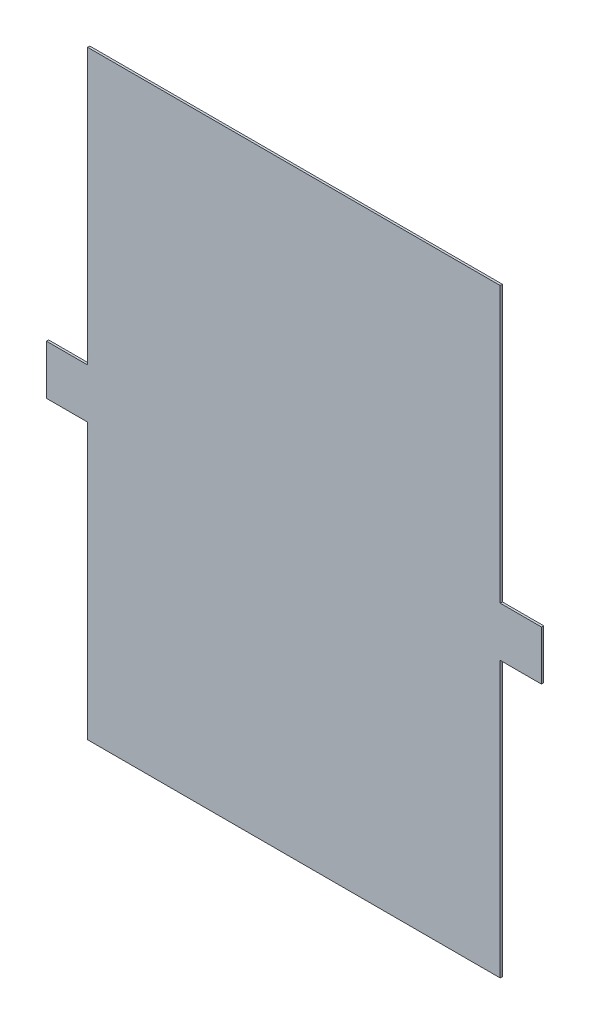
ISO-10303-21;
HEADER;
FILE_DESCRIPTION(('STEP AP214'),'2;1');
FILE_NAME('part.step','',(''),(''),'','','');
FILE_SCHEMA(('AUTOMOTIVE_DESIGN { 1 0 10303 214 1 1 1 1 }'));
ENDSEC;
DATA;
#1=APPLICATION_CONTEXT('core data for automotive mechanical design processes');
#2=APPLICATION_PROTOCOL_DEFINITION('international standard','automotive_design',2000,#1);
#3=PRODUCT_CONTEXT('',#1,'mechanical');
#4=PRODUCT('Part','Part','',(#3));
#5=PRODUCT_RELATED_PRODUCT_CATEGORY('part','',(#4));
#6=PRODUCT_DEFINITION_FORMATION('','',#4);
#7=PRODUCT_DEFINITION_CONTEXT('part definition',#1,'design');
#8=PRODUCT_DEFINITION('design','',#6,#7);
#9=PRODUCT_DEFINITION_SHAPE('','',#8);
#10=(LENGTH_UNIT() NAMED_UNIT(*) SI_UNIT(.MILLI.,.METRE.));
#11=(NAMED_UNIT(*) PLANE_ANGLE_UNIT() SI_UNIT($,.RADIAN.));
#12=(NAMED_UNIT(*) SI_UNIT($,.STERADIAN.) SOLID_ANGLE_UNIT());
#13=UNCERTAINTY_MEASURE_WITH_UNIT(LENGTH_MEASURE(1.E-05),#10,'distance_accuracy_value','');
#14=(GEOMETRIC_REPRESENTATION_CONTEXT(3) GLOBAL_UNCERTAINTY_ASSIGNED_CONTEXT((#13)) GLOBAL_UNIT_ASSIGNED_CONTEXT((#10,
#11,#12)) REPRESENTATION_CONTEXT('',''));
#15=CARTESIAN_POINT('',(0.,0.,0.));
#16=DIRECTION('',(0.,0.,1.));
#17=DIRECTION('',(1.,0.,0.));
#18=AXIS2_PLACEMENT_3D('',#15,#16,#17);
#19=CARTESIAN_POINT('',(-251.568085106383,267.960992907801,2.032));
#20=DIRECTION('',(1.,0.,0.));
#21=DIRECTION('',(0.,0.,-1.));
#22=AXIS2_PLACEMENT_3D('',#19,#20,#21);
#23=PLANE('',#22);
#24=DIRECTION('',(0.,-1.,0.));
#25=VECTOR('',#24,1.);
#26=CARTESIAN_POINT('',(-251.568085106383,267.960992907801,0.));
#27=LINE('',#26,#25);
#28=CARTESIAN_POINT('',(-251.568085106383,267.960992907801,0.));
#29=VERTEX_POINT('',#28);
#30=CARTESIAN_POINT('',(-251.568085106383,13.9609929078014,0.));
#31=VERTEX_POINT('',#30);
#32=EDGE_CURVE('E153',#29,#31,#27,.T.);
#33=ORIENTED_EDGE('',*,*,#32,.T.);
#34=DIRECTION('',(0.,0.,-1.));
#35=VECTOR('',#34,1.);
#36=CARTESIAN_POINT('',(-251.568085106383,13.9609929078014,2.032));
#37=LINE('',#36,#35);
#38=CARTESIAN_POINT('',(-251.568085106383,13.9609929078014,2.032));
#39=VERTEX_POINT('',#38);
#40=EDGE_CURVE('E11',#39,#31,#37,.T.);
#41=ORIENTED_EDGE('',*,*,#40,.F.);
#42=DIRECTION('',(0.,-1.,0.));
#43=VECTOR('',#42,1.);
#44=CARTESIAN_POINT('',(-251.568085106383,267.960992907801,2.032));
#45=LINE('',#44,#43);
#46=CARTESIAN_POINT('',(-251.568085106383,267.960992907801,2.032));
#47=VERTEX_POINT('',#46);
#48=EDGE_CURVE('E175',#47,#39,#45,.T.);
#49=ORIENTED_EDGE('',*,*,#48,.F.);
#50=DIRECTION('',(0.,0.,-1.));
#51=VECTOR('',#50,1.);
#52=CARTESIAN_POINT('',(-251.568085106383,267.960992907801,2.032));
#53=LINE('',#52,#51);
#54=EDGE_CURVE('E149',#47,#29,#53,.T.);
#55=ORIENTED_EDGE('',*,*,#54,.T.);
#56=EDGE_LOOP('',(#33,#41,#49,#55));
#57=FACE_BOUND('',#56,.T.);
#58=ADVANCED_FACE('F33',(#57),#23,.F.);
#59=CARTESIAN_POINT('',(-251.568085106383,13.9609929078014,2.032));
#60=DIRECTION('',(0.,-1.,0.));
#61=DIRECTION('',(1.,0.,0.));
#62=AXIS2_PLACEMENT_3D('',#59,#60,#61);
#63=PLANE('',#62);
#64=DIRECTION('',(-1.,0.,0.));
#65=VECTOR('',#64,1.);
#66=CARTESIAN_POINT('',(-251.568085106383,13.9609929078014,0.));
#67=LINE('',#66,#65);
#68=CARTESIAN_POINT('',(-289.668085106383,13.9609929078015,0.));
#69=VERTEX_POINT('',#68);
#70=EDGE_CURVE('E156',#31,#69,#67,.T.);
#71=ORIENTED_EDGE('',*,*,#70,.T.);
#72=DIRECTION('',(0.,0.,-1.));
#73=VECTOR('',#72,1.);
#74=CARTESIAN_POINT('',(-289.668085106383,13.9609929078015,2.032));
#75=LINE('',#74,#73);
#76=CARTESIAN_POINT('',(-289.668085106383,13.9609929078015,2.032));
#77=VERTEX_POINT('',#76);
#78=EDGE_CURVE('E41',#77,#69,#75,.T.);
#79=ORIENTED_EDGE('',*,*,#78,.F.);
#80=DIRECTION('',(-1.,0.,0.));
#81=VECTOR('',#80,1.);
#82=CARTESIAN_POINT('',(-251.568085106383,13.9609929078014,2.032));
#83=LINE('',#82,#81);
#84=EDGE_CURVE('E104',#39,#77,#83,.T.);
#85=ORIENTED_EDGE('',*,*,#84,.F.);
#86=ORIENTED_EDGE('',*,*,#40,.T.);
#87=EDGE_LOOP('',(#71,#79,#85,#86));
#88=FACE_BOUND('',#87,.T.);
#89=ADVANCED_FACE('F253',(#88),#63,.F.);
#90=CARTESIAN_POINT('',(-289.668085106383,13.9609929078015,2.032));
#91=DIRECTION('',(1.,0.,0.));
#92=DIRECTION('',(0.,1.,0.));
#93=AXIS2_PLACEMENT_3D('',#90,#91,#92);
#94=PLANE('',#93);
#95=DIRECTION('',(0.,-1.,0.));
#96=VECTOR('',#95,1.);
#97=CARTESIAN_POINT('',(-289.668085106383,13.9609929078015,0.));
#98=LINE('',#97,#96);
#99=CARTESIAN_POINT('',(-289.668085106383,-31.7590070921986,0.));
#100=VERTEX_POINT('',#99);
#101=EDGE_CURVE('E158',#69,#100,#98,.T.);
#102=ORIENTED_EDGE('',*,*,#101,.T.);
#103=DIRECTION('',(0.,0.,-1.));
#104=VECTOR('',#103,1.);
#105=CARTESIAN_POINT('',(-289.668085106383,-31.7590070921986,2.032));
#106=LINE('',#105,#104);
#107=CARTESIAN_POINT('',(-289.668085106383,-31.7590070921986,2.032));
#108=VERTEX_POINT('',#107);
#109=EDGE_CURVE('E194',#108,#100,#106,.T.);
#110=ORIENTED_EDGE('',*,*,#109,.F.);
#111=DIRECTION('',(0.,-1.,0.));
#112=VECTOR('',#111,1.);
#113=CARTESIAN_POINT('',(-289.668085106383,13.9609929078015,2.032));
#114=LINE('',#113,#112);
#115=EDGE_CURVE('E202',#77,#108,#114,.T.);
#116=ORIENTED_EDGE('',*,*,#115,.F.);
#117=ORIENTED_EDGE('',*,*,#78,.T.);
#118=EDGE_LOOP('',(#102,#110,#116,#117));
#119=FACE_BOUND('',#118,.T.);
#120=ADVANCED_FACE('F200',(#119),#94,.F.);
#121=CARTESIAN_POINT('',(-289.668085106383,-31.7590070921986,2.032));
#122=DIRECTION('',(0.,1.,0.));
#123=DIRECTION('',(0.,0.,1.));
#124=AXIS2_PLACEMENT_3D('',#121,#122,#123);
#125=PLANE('',#124);
#126=DIRECTION('',(1.,0.,0.));
#127=VECTOR('',#126,1.);
#128=CARTESIAN_POINT('',(-289.668085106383,-31.7590070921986,0.));
#129=LINE('',#128,#127);
#130=CARTESIAN_POINT('',(-251.568085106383,-31.7590070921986,0.));
#131=VERTEX_POINT('',#130);
#132=EDGE_CURVE('E160',#100,#131,#129,.T.);
#133=ORIENTED_EDGE('',*,*,#132,.T.);
#134=DIRECTION('',(0.,0.,-1.));
#135=VECTOR('',#134,1.);
#136=CARTESIAN_POINT('',(-251.568085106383,-31.7590070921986,2.032));
#137=LINE('',#136,#135);
#138=CARTESIAN_POINT('',(-251.568085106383,-31.7590070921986,2.032));
#139=VERTEX_POINT('',#138);
#140=EDGE_CURVE('E191',#139,#131,#137,.T.);
#141=ORIENTED_EDGE('',*,*,#140,.F.);
#142=DIRECTION('',(1.,0.,0.));
#143=VECTOR('',#142,1.);
#144=CARTESIAN_POINT('',(-289.668085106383,-31.7590070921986,2.032));
#145=LINE('',#144,#143);
#146=EDGE_CURVE('E220',#108,#139,#145,.T.);
#147=ORIENTED_EDGE('',*,*,#146,.F.);
#148=ORIENTED_EDGE('',*,*,#109,.T.);
#149=EDGE_LOOP('',(#133,#141,#147,#148));
#150=FACE_BOUND('',#149,.T.);
#151=ADVANCED_FACE('F211',(#150),#125,.F.);
#152=CARTESIAN_POINT('',(-251.568085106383,-31.7590070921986,2.032));
#153=DIRECTION('',(1.,0.,0.));
#154=DIRECTION('',(0.,1.,0.));
#155=AXIS2_PLACEMENT_3D('',#152,#153,#154);
#156=PLANE('',#155);
#157=DIRECTION('',(0.,-1.,0.));
#158=VECTOR('',#157,1.);
#159=CARTESIAN_POINT('',(-251.568085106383,-31.7590070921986,0.));
#160=LINE('',#159,#158);
#161=CARTESIAN_POINT('',(-251.568085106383,-285.759007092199,0.));
#162=VERTEX_POINT('',#161);
#163=EDGE_CURVE('E162',#131,#162,#160,.T.);
#164=ORIENTED_EDGE('',*,*,#163,.T.);
#165=DIRECTION('',(0.,0.,-1.));
#166=VECTOR('',#165,1.);
#167=CARTESIAN_POINT('',(-251.568085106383,-285.759007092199,2.032));
#168=LINE('',#167,#166);
#169=CARTESIAN_POINT('',(-251.568085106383,-285.759007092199,2.032));
#170=VERTEX_POINT('',#169);
#171=EDGE_CURVE('E188',#170,#162,#168,.T.);
#172=ORIENTED_EDGE('',*,*,#171,.F.);
#173=DIRECTION('',(0.,-1.,0.));
#174=VECTOR('',#173,1.);
#175=CARTESIAN_POINT('',(-251.568085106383,-31.7590070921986,2.032));
#176=LINE('',#175,#174);
#177=EDGE_CURVE('E217',#139,#170,#176,.T.);
#178=ORIENTED_EDGE('',*,*,#177,.F.);
#179=ORIENTED_EDGE('',*,*,#140,.T.);
#180=EDGE_LOOP('',(#164,#172,#178,#179));
#181=FACE_BOUND('',#180,.T.);
#182=ADVANCED_FACE('F215',(#181),#156,.F.);
#183=CARTESIAN_POINT('',(-251.568085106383,-285.759007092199,2.032));
#184=DIRECTION('',(0.,1.,0.));
#185=DIRECTION('',(0.,0.,1.));
#186=AXIS2_PLACEMENT_3D('',#183,#184,#185);
#187=PLANE('',#186);
#188=DIRECTION('',(1.,0.,0.));
#189=VECTOR('',#188,1.);
#190=CARTESIAN_POINT('',(-251.568085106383,-285.759007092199,0.));
#191=LINE('',#190,#189);
#192=CARTESIAN_POINT('',(129.431914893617,-285.759007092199,0.));
#193=VERTEX_POINT('',#192);
#194=EDGE_CURVE('E164',#162,#193,#191,.T.);
#195=ORIENTED_EDGE('',*,*,#194,.T.);
#196=DIRECTION('',(0.,0.,-1.));
#197=VECTOR('',#196,1.);
#198=CARTESIAN_POINT('',(129.431914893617,-285.759007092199,2.032));
#199=LINE('',#198,#197);
#200=CARTESIAN_POINT('',(129.431914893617,-285.759007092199,2.032));
#201=VERTEX_POINT('',#200);
#202=EDGE_CURVE('E185',#201,#193,#199,.T.);
#203=ORIENTED_EDGE('',*,*,#202,.F.);
#204=DIRECTION('',(1.,0.,0.));
#205=VECTOR('',#204,1.);
#206=CARTESIAN_POINT('',(-251.568085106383,-285.759007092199,2.032));
#207=LINE('',#206,#205);
#208=EDGE_CURVE('E219',#170,#201,#207,.T.);
#209=ORIENTED_EDGE('',*,*,#208,.F.);
#210=ORIENTED_EDGE('',*,*,#171,.T.);
#211=EDGE_LOOP('',(#195,#203,#209,#210));
#212=FACE_BOUND('',#211,.T.);
#213=ADVANCED_FACE('F266',(#212),#187,.F.);
#214=CARTESIAN_POINT('',(129.431914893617,-31.7590070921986,2.032));
#215=DIRECTION('',(-1.,0.,0.));
#216=DIRECTION('',(0.,-1.,0.));
#217=AXIS2_PLACEMENT_3D('',#214,#215,#216);
#218=PLANE('',#217);
#219=DIRECTION('',(0.,1.,0.));
#220=VECTOR('',#219,1.);
#221=CARTESIAN_POINT('',(129.431914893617,-31.7590070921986,0.));
#222=LINE('',#221,#220);
#223=CARTESIAN_POINT('',(129.431914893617,-31.7590070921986,0.));
#224=VERTEX_POINT('',#223);
#225=EDGE_CURVE('E166',#193,#224,#222,.T.);
#226=ORIENTED_EDGE('',*,*,#225,.T.);
#227=DIRECTION('',(0.,0.,-1.));
#228=VECTOR('',#227,1.);
#229=CARTESIAN_POINT('',(129.431914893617,-31.7590070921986,2.032));
#230=LINE('',#229,#228);
#231=CARTESIAN_POINT('',(129.431914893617,-31.7590070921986,2.032));
#232=VERTEX_POINT('',#231);
#233=EDGE_CURVE('E182',#232,#224,#230,.T.);
#234=ORIENTED_EDGE('',*,*,#233,.F.);
#235=DIRECTION('',(0.,1.,0.));
#236=VECTOR('',#235,1.);
#237=CARTESIAN_POINT('',(129.431914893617,-31.7590070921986,2.032));
#238=LINE('',#237,#236);
#239=EDGE_CURVE('E222',#201,#232,#238,.T.);
#240=ORIENTED_EDGE('',*,*,#239,.F.);
#241=ORIENTED_EDGE('',*,*,#202,.T.);
#242=EDGE_LOOP('',(#226,#234,#240,#241));
#243=FACE_BOUND('',#242,.T.);
#244=ADVANCED_FACE('F269',(#243),#218,.F.);
#245=CARTESIAN_POINT('',(167.531914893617,-31.7590070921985,2.032));
#246=DIRECTION('',(0.,1.,0.));
#247=DIRECTION('',(-1.,0.,0.));
#248=AXIS2_PLACEMENT_3D('',#245,#246,#247);
#249=PLANE('',#248);
#250=DIRECTION('',(1.,0.,0.));
#251=VECTOR('',#250,1.);
#252=CARTESIAN_POINT('',(167.531914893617,-31.7590070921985,0.));
#253=LINE('',#252,#251);
#254=CARTESIAN_POINT('',(167.531914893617,-31.7590070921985,0.));
#255=VERTEX_POINT('',#254);
#256=EDGE_CURVE('E168',#224,#255,#253,.T.);
#257=ORIENTED_EDGE('',*,*,#256,.T.);
#258=DIRECTION('',(0.,0.,-1.));
#259=VECTOR('',#258,1.);
#260=CARTESIAN_POINT('',(167.531914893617,-31.7590070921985,2.032));
#261=LINE('',#260,#259);
#262=CARTESIAN_POINT('',(167.531914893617,-31.7590070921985,2.032));
#263=VERTEX_POINT('',#262);
#264=EDGE_CURVE('E179',#263,#255,#261,.T.);
#265=ORIENTED_EDGE('',*,*,#264,.F.);
#266=DIRECTION('',(1.,0.,0.));
#267=VECTOR('',#266,1.);
#268=CARTESIAN_POINT('',(167.531914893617,-31.7590070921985,2.032));
#269=LINE('',#268,#267);
#270=EDGE_CURVE('E228',#232,#263,#269,.T.);
#271=ORIENTED_EDGE('',*,*,#270,.F.);
#272=ORIENTED_EDGE('',*,*,#233,.T.);
#273=EDGE_LOOP('',(#257,#265,#271,#272));
#274=FACE_BOUND('',#273,.T.);
#275=ADVANCED_FACE('F234',(#274),#249,.F.);
#276=CARTESIAN_POINT('',(167.531914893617,13.9609929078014,2.032));
#277=DIRECTION('',(-1.,0.,0.));
#278=DIRECTION('',(0.,0.,1.));
#279=AXIS2_PLACEMENT_3D('',#276,#277,#278);
#280=PLANE('',#279);
#281=DIRECTION('',(0.,1.,0.));
#282=VECTOR('',#281,1.);
#283=CARTESIAN_POINT('',(167.531914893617,13.9609929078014,0.));
#284=LINE('',#283,#282);
#285=CARTESIAN_POINT('',(167.531914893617,13.9609929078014,0.));
#286=VERTEX_POINT('',#285);
#287=EDGE_CURVE('E170',#255,#286,#284,.T.);
#288=ORIENTED_EDGE('',*,*,#287,.T.);
#289=DIRECTION('',(0.,0.,-1.));
#290=VECTOR('',#289,1.);
#291=CARTESIAN_POINT('',(167.531914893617,13.9609929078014,2.032));
#292=LINE('',#291,#290);
#293=CARTESIAN_POINT('',(167.531914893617,13.9609929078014,2.032));
#294=VERTEX_POINT('',#293);
#295=EDGE_CURVE('E144',#294,#286,#292,.T.);
#296=ORIENTED_EDGE('',*,*,#295,.F.);
#297=DIRECTION('',(0.,1.,0.));
#298=VECTOR('',#297,1.);
#299=CARTESIAN_POINT('',(167.531914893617,13.9609929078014,2.032));
#300=LINE('',#299,#298);
#301=EDGE_CURVE('E135',#263,#294,#300,.T.);
#302=ORIENTED_EDGE('',*,*,#301,.F.);
#303=ORIENTED_EDGE('',*,*,#264,.T.);
#304=EDGE_LOOP('',(#288,#296,#302,#303));
#305=FACE_BOUND('',#304,.T.);
#306=ADVANCED_FACE('F238',(#305),#280,.F.);
#307=CARTESIAN_POINT('',(129.431914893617,13.9609929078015,2.032));
#308=DIRECTION('',(0.,-1.,0.));
#309=DIRECTION('',(1.,0.,0.));
#310=AXIS2_PLACEMENT_3D('',#307,#308,#309);
#311=PLANE('',#310);
#312=DIRECTION('',(-1.,0.,0.));
#313=VECTOR('',#312,1.);
#314=CARTESIAN_POINT('',(129.431914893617,13.9609929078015,0.));
#315=LINE('',#314,#313);
#316=CARTESIAN_POINT('',(129.431914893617,13.9609929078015,0.));
#317=VERTEX_POINT('',#316);
#318=EDGE_CURVE('E143',#286,#317,#315,.T.);
#319=ORIENTED_EDGE('',*,*,#318,.T.);
#320=DIRECTION('',(0.,0.,-1.));
#321=VECTOR('',#320,1.);
#322=CARTESIAN_POINT('',(129.431914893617,13.9609929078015,2.032));
#323=LINE('',#322,#321);
#324=CARTESIAN_POINT('',(129.431914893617,13.9609929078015,2.032));
#325=VERTEX_POINT('',#324);
#326=EDGE_CURVE('E140',#325,#317,#323,.T.);
#327=ORIENTED_EDGE('',*,*,#326,.F.);
#328=DIRECTION('',(-1.,0.,0.));
#329=VECTOR('',#328,1.);
#330=CARTESIAN_POINT('',(129.431914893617,13.9609929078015,2.032));
#331=LINE('',#330,#329);
#332=EDGE_CURVE('E129',#294,#325,#331,.T.);
#333=ORIENTED_EDGE('',*,*,#332,.F.);
#334=ORIENTED_EDGE('',*,*,#295,.T.);
#335=EDGE_LOOP('',(#319,#327,#333,#334));
#336=FACE_BOUND('',#335,.T.);
#337=ADVANCED_FACE('F141',(#336),#311,.F.);
#338=CARTESIAN_POINT('',(129.431914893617,267.960992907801,2.032));
#339=DIRECTION('',(-1.,0.,0.));
#340=DIRECTION('',(0.,0.,1.));
#341=AXIS2_PLACEMENT_3D('',#338,#339,#340);
#342=PLANE('',#341);
#343=DIRECTION('',(0.,1.,0.));
#344=VECTOR('',#343,1.);
#345=CARTESIAN_POINT('',(129.431914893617,267.960992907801,0.));
#346=LINE('',#345,#344);
#347=CARTESIAN_POINT('',(129.431914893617,267.960992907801,0.));
#348=VERTEX_POINT('',#347);
#349=EDGE_CURVE('E90',#317,#348,#346,.T.);
#350=ORIENTED_EDGE('',*,*,#349,.T.);
#351=DIRECTION('',(0.,0.,-1.));
#352=VECTOR('',#351,1.);
#353=CARTESIAN_POINT('',(129.431914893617,267.960992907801,2.032));
#354=LINE('',#353,#352);
#355=CARTESIAN_POINT('',(129.431914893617,267.960992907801,2.032));
#356=VERTEX_POINT('',#355);
#357=EDGE_CURVE('E145',#356,#348,#354,.T.);
#358=ORIENTED_EDGE('',*,*,#357,.F.);
#359=DIRECTION('',(0.,1.,0.));
#360=VECTOR('',#359,1.);
#361=CARTESIAN_POINT('',(129.431914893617,267.960992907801,2.032));
#362=LINE('',#361,#360);
#363=EDGE_CURVE('E133',#325,#356,#362,.T.);
#364=ORIENTED_EDGE('',*,*,#363,.F.);
#365=ORIENTED_EDGE('',*,*,#326,.T.);
#366=EDGE_LOOP('',(#350,#358,#364,#365));
#367=FACE_BOUND('',#366,.T.);
#368=ADVANCED_FACE('F147',(#367),#342,.F.);
#369=CARTESIAN_POINT('',(-251.568085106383,267.960992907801,2.032));
#370=DIRECTION('',(0.,-1.,0.));
#371=DIRECTION('',(0.,0.,-1.));
#372=AXIS2_PLACEMENT_3D('',#369,#370,#371);
#373=PLANE('',#372);
#374=DIRECTION('',(-1.,0.,0.));
#375=VECTOR('',#374,1.);
#376=CARTESIAN_POINT('',(-251.568085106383,267.960992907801,0.));
#377=LINE('',#376,#375);
#378=EDGE_CURVE('E96',#348,#29,#377,.T.);
#379=ORIENTED_EDGE('',*,*,#378,.T.);
#380=ORIENTED_EDGE('',*,*,#54,.F.);
#381=DIRECTION('',(-1.,0.,0.));
#382=VECTOR('',#381,1.);
#383=CARTESIAN_POINT('',(-251.568085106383,267.960992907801,2.032));
#384=LINE('',#383,#382);
#385=EDGE_CURVE('E49',#356,#47,#384,.T.);
#386=ORIENTED_EDGE('',*,*,#385,.F.);
#387=ORIENTED_EDGE('',*,*,#357,.T.);
#388=EDGE_LOOP('',(#379,#380,#386,#387));
#389=FACE_BOUND('',#388,.T.);
#390=ADVANCED_FACE('F242',(#389),#373,.F.);
#391=CARTESIAN_POINT('',(0.,0.,2.032));
#392=DIRECTION('',(0.,0.,-1.));
#393=DIRECTION('',(-1.,0.,0.));
#394=AXIS2_PLACEMENT_3D('',#391,#392,#393);
#395=PLANE('',#394);
#396=ORIENTED_EDGE('',*,*,#48,.T.);
#397=ORIENTED_EDGE('',*,*,#84,.T.);
#398=ORIENTED_EDGE('',*,*,#115,.T.);
#399=ORIENTED_EDGE('',*,*,#146,.T.);
#400=ORIENTED_EDGE('',*,*,#177,.T.);
#401=ORIENTED_EDGE('',*,*,#208,.T.);
#402=ORIENTED_EDGE('',*,*,#239,.T.);
#403=ORIENTED_EDGE('',*,*,#270,.T.);
#404=ORIENTED_EDGE('',*,*,#301,.T.);
#405=ORIENTED_EDGE('',*,*,#332,.T.);
#406=ORIENTED_EDGE('',*,*,#363,.T.);
#407=ORIENTED_EDGE('',*,*,#385,.T.);
#408=EDGE_LOOP('',(#396,#397,#398,#399,#400,#401,#402,#403,#404,#405,#406,#407));
#409=FACE_BOUND('',#408,.T.);
#410=ADVANCED_FACE('F131',(#409),#395,.F.);
#411=CARTESIAN_POINT('',(0.,0.,0.));
#412=DIRECTION('',(0.,0.,-1.));
#413=DIRECTION('',(-1.,0.,0.));
#414=AXIS2_PLACEMENT_3D('',#411,#412,#413);
#415=PLANE('',#414);
#416=ORIENTED_EDGE('',*,*,#32,.F.);
#417=ORIENTED_EDGE('',*,*,#378,.F.);
#418=ORIENTED_EDGE('',*,*,#349,.F.);
#419=ORIENTED_EDGE('',*,*,#318,.F.);
#420=ORIENTED_EDGE('',*,*,#287,.F.);
#421=ORIENTED_EDGE('',*,*,#256,.F.);
#422=ORIENTED_EDGE('',*,*,#225,.F.);
#423=ORIENTED_EDGE('',*,*,#194,.F.);
#424=ORIENTED_EDGE('',*,*,#163,.F.);
#425=ORIENTED_EDGE('',*,*,#132,.F.);
#426=ORIENTED_EDGE('',*,*,#101,.F.);
#427=ORIENTED_EDGE('',*,*,#70,.F.);
#428=EDGE_LOOP('',(#416,#417,#418,#419,#420,#421,#422,#423,#424,#425,#426,#427));
#429=FACE_BOUND('',#428,.T.);
#430=ADVANCED_FACE('F206',(#429),#415,.T.);
#431=CLOSED_SHELL('',(#58,#89,#120,#151,#182,#213,#244,#275,#306,#337,#368,#390,#410,#430));
#432=MANIFOLD_SOLID_BREP('B2',#431);
#433=ADVANCED_BREP_SHAPE_REPRESENTATION('',(#18,#432),#14);
#434=SHAPE_DEFINITION_REPRESENTATION(#9,#433);
ENDSEC;
END-ISO-10303-21;
